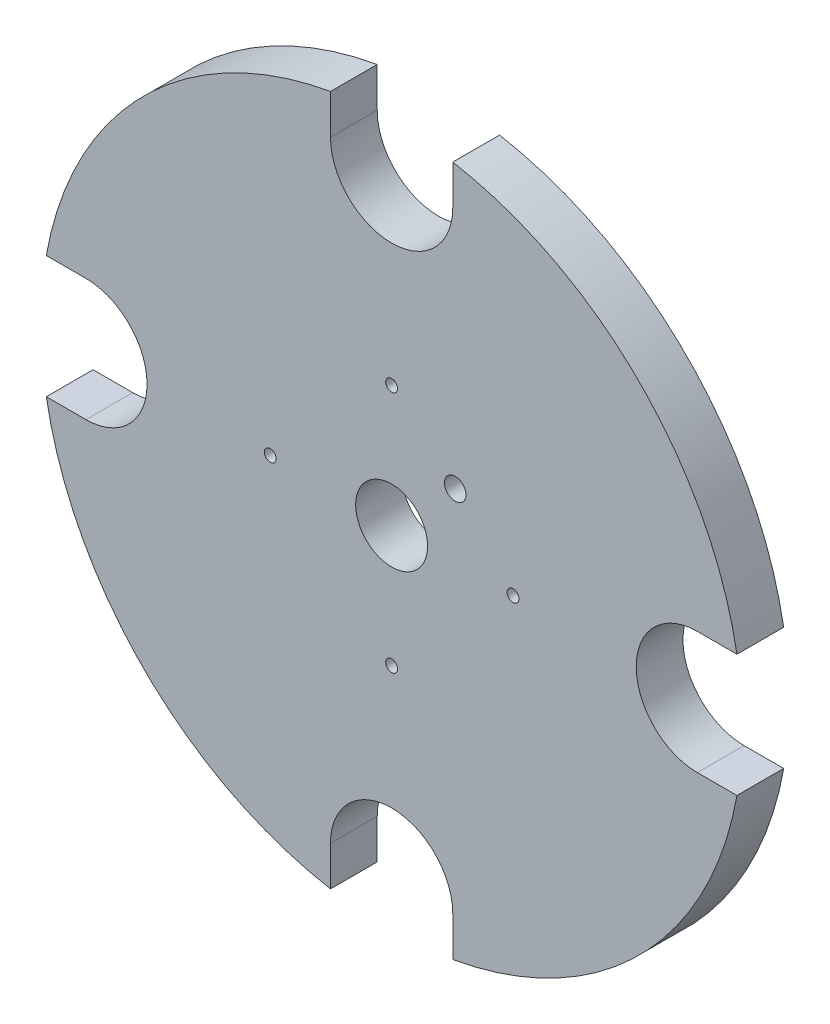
ISO-10303-21;
HEADER;
FILE_DESCRIPTION(('STEP AP214'),'2;1');
FILE_NAME('part.step','',(''),(''),'','','');
FILE_SCHEMA(('AUTOMOTIVE_DESIGN { 1 0 10303 214 1 1 1 1 }'));
ENDSEC;
DATA;
#1=APPLICATION_CONTEXT('core data for automotive mechanical design processes');
#2=APPLICATION_PROTOCOL_DEFINITION('international standard','automotive_design',2000,#1);
#3=PRODUCT_CONTEXT('',#1,'mechanical');
#4=PRODUCT('Part','Part','',(#3));
#5=PRODUCT_RELATED_PRODUCT_CATEGORY('part','',(#4));
#6=PRODUCT_DEFINITION_FORMATION('','',#4);
#7=PRODUCT_DEFINITION_CONTEXT('part definition',#1,'design');
#8=PRODUCT_DEFINITION('design','',#6,#7);
#9=PRODUCT_DEFINITION_SHAPE('','',#8);
#10=(LENGTH_UNIT() NAMED_UNIT(*) SI_UNIT(.MILLI.,.METRE.));
#11=(NAMED_UNIT(*) PLANE_ANGLE_UNIT() SI_UNIT($,.RADIAN.));
#12=(NAMED_UNIT(*) SI_UNIT($,.STERADIAN.) SOLID_ANGLE_UNIT());
#13=UNCERTAINTY_MEASURE_WITH_UNIT(LENGTH_MEASURE(1.E-05),#10,'distance_accuracy_value','');
#14=(GEOMETRIC_REPRESENTATION_CONTEXT(3) GLOBAL_UNCERTAINTY_ASSIGNED_CONTEXT((#13)) GLOBAL_UNIT_ASSIGNED_CONTEXT((#10,
#11,#12)) REPRESENTATION_CONTEXT('',''));
#15=CARTESIAN_POINT('',(0.,0.,0.));
#16=DIRECTION('',(0.,0.,1.));
#17=DIRECTION('',(1.,0.,0.));
#18=AXIS2_PLACEMENT_3D('',#15,#16,#17);
#19=CARTESIAN_POINT('',(35.3553390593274,35.3553390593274,-1.04603825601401E-11));
#20=DIRECTION('',(0.,0.,1.));
#21=DIRECTION('',(1.,0.,0.));
#22=AXIS2_PLACEMENT_3D('',#19,#20,#21);
#23=CYLINDRICAL_SURFACE('',#22,6.00000000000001);
#24=CARTESIAN_POINT('',(35.3553390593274,35.3553390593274,26.));
#25=DIRECTION('',(0.,0.,1.));
#26=DIRECTION('',(1.,0.,0.));
#27=AXIS2_PLACEMENT_3D('',#24,#25,#26);
#28=CIRCLE('',#27,6.00000000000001);
#29=CARTESIAN_POINT('',(41.3553390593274,35.3553390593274,26.));
#30=VERTEX_POINT('',#29);
#31=EDGE_CURVE('E381',#30,#30,#28,.T.);
#32=ORIENTED_EDGE('',*,*,#31,.T.);
#33=EDGE_LOOP('',(#32));
#34=FACE_BOUND('',#33,.T.);
#35=CARTESIAN_POINT('',(35.3553390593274,35.3553390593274,14.));
#36=DIRECTION('',(0.,0.,-1.));
#37=DIRECTION('',(-1.,0.,0.));
#38=AXIS2_PLACEMENT_3D('',#35,#36,#37);
#39=CIRCLE('',#38,6.00000000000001);
#40=CARTESIAN_POINT('',(29.3553390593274,35.3553390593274,14.));
#41=VERTEX_POINT('',#40);
#42=EDGE_CURVE('E36',#41,#41,#39,.F.);
#43=ORIENTED_EDGE('',*,*,#42,.F.);
#44=EDGE_LOOP('',(#43));
#45=FACE_BOUND('',#44,.T.);
#46=ADVANCED_FACE('F32',(#34,#45),#23,.F.);
#47=CARTESIAN_POINT('',(0.,0.,26.));
#48=DIRECTION('',(0.,0.,-1.));
#49=DIRECTION('',(-1.,0.,0.));
#50=AXIS2_PLACEMENT_3D('',#47,#48,#49);
#51=CYLINDRICAL_SURFACE('',#50,195.);
#52=CARTESIAN_POINT('',(0.,0.,26.));
#53=DIRECTION('',(0.,0.,1.));
#54=DIRECTION('',(1.,0.,0.));
#55=AXIS2_PLACEMENT_3D('',#52,#53,#54);
#56=CIRCLE('',#55,195.);
#57=CARTESIAN_POINT('',(-33.999999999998,192.013020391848,26.));
#58=VERTEX_POINT('',#57);
#59=CARTESIAN_POINT('',(-192.013020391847,34.0000000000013,26.));
#60=VERTEX_POINT('',#59);
#61=EDGE_CURVE('E41',#58,#60,#56,.T.);
#62=ORIENTED_EDGE('',*,*,#61,.F.);
#63=DIRECTION('',(0.,0.,1.));
#64=VECTOR('',#63,1.);
#65=CARTESIAN_POINT('',(-33.999999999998,192.013020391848,0.));
#66=LINE('',#65,#64);
#67=CARTESIAN_POINT('',(-33.999999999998,192.013020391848,0.));
#68=VERTEX_POINT('',#67);
#69=EDGE_CURVE('E180',#68,#58,#66,.T.);
#70=ORIENTED_EDGE('',*,*,#69,.F.);
#71=CARTESIAN_POINT('',(0.,0.,0.));
#72=DIRECTION('',(0.,0.,1.));
#73=DIRECTION('',(1.,0.,0.));
#74=AXIS2_PLACEMENT_3D('',#71,#72,#73);
#75=CIRCLE('',#74,195.);
#76=CARTESIAN_POINT('',(-192.013020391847,34.0000000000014,0.));
#77=VERTEX_POINT('',#76);
#78=EDGE_CURVE('E271',#68,#77,#75,.T.);
#79=ORIENTED_EDGE('',*,*,#78,.T.);
#80=DIRECTION('',(0.,0.,1.));
#81=VECTOR('',#80,1.);
#82=CARTESIAN_POINT('',(-192.013020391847,34.0000000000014,0.));
#83=LINE('',#82,#81);
#84=EDGE_CURVE('E205',#77,#60,#83,.T.);
#85=ORIENTED_EDGE('',*,*,#84,.T.);
#86=EDGE_LOOP('',(#62,#70,#79,#85));
#87=FACE_BOUND('',#86,.T.);
#88=ADVANCED_FACE('F312',(#87),#51,.T.);
#89=CARTESIAN_POINT('',(-192.013020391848,-33.9999999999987,26.));
#90=VERTEX_POINT('',#89);
#91=CARTESIAN_POINT('',(-34.0000000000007,-192.013020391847,26.));
#92=VERTEX_POINT('',#91);
#93=EDGE_CURVE('E275',#90,#92,#56,.T.);
#94=ORIENTED_EDGE('',*,*,#93,.F.);
#95=DIRECTION('',(0.,0.,1.));
#96=VECTOR('',#95,1.);
#97=CARTESIAN_POINT('',(-192.013020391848,-33.9999999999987,0.));
#98=LINE('',#97,#96);
#99=CARTESIAN_POINT('',(-192.013020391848,-33.9999999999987,0.));
#100=VERTEX_POINT('',#99);
#101=EDGE_CURVE('E203',#100,#90,#98,.T.);
#102=ORIENTED_EDGE('',*,*,#101,.F.);
#103=CARTESIAN_POINT('',(-34.0000000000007,-192.013020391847,0.));
#104=VERTEX_POINT('',#103);
#105=EDGE_CURVE('E276',#100,#104,#75,.T.);
#106=ORIENTED_EDGE('',*,*,#105,.T.);
#107=DIRECTION('',(0.,0.,1.));
#108=VECTOR('',#107,1.);
#109=CARTESIAN_POINT('',(-34.0000000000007,-192.013020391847,0.));
#110=LINE('',#109,#108);
#111=EDGE_CURVE('E232',#104,#92,#110,.T.);
#112=ORIENTED_EDGE('',*,*,#111,.T.);
#113=EDGE_LOOP('',(#94,#102,#106,#112));
#114=FACE_BOUND('',#113,.T.);
#115=ADVANCED_FACE('F286',(#114),#51,.T.);
#116=CARTESIAN_POINT('',(33.9999999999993,-192.013020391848,26.));
#117=VERTEX_POINT('',#116);
#118=CARTESIAN_POINT('',(192.013020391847,-34.,26.));
#119=VERTEX_POINT('',#118);
#120=EDGE_CURVE('E42',#117,#119,#56,.T.);
#121=ORIENTED_EDGE('',*,*,#120,.F.);
#122=DIRECTION('',(0.,0.,1.));
#123=VECTOR('',#122,1.);
#124=CARTESIAN_POINT('',(33.9999999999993,-192.013020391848,0.));
#125=LINE('',#124,#123);
#126=CARTESIAN_POINT('',(33.9999999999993,-192.013020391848,0.));
#127=VERTEX_POINT('',#126);
#128=EDGE_CURVE('E230',#127,#117,#125,.T.);
#129=ORIENTED_EDGE('',*,*,#128,.F.);
#130=CARTESIAN_POINT('',(192.013020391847,-34.,0.));
#131=VERTEX_POINT('',#130);
#132=EDGE_CURVE('E268',#127,#131,#75,.T.);
#133=ORIENTED_EDGE('',*,*,#132,.T.);
#134=DIRECTION('',(0.,0.,1.));
#135=VECTOR('',#134,1.);
#136=CARTESIAN_POINT('',(192.013020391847,-34.,0.));
#137=LINE('',#136,#135);
#138=EDGE_CURVE('E259',#131,#119,#137,.T.);
#139=ORIENTED_EDGE('',*,*,#138,.T.);
#140=EDGE_LOOP('',(#121,#129,#133,#139));
#141=FACE_BOUND('',#140,.T.);
#142=ADVANCED_FACE('F404',(#141),#51,.T.);
#143=CARTESIAN_POINT('',(0.,0.,26.));
#144=DIRECTION('',(0.,0.,1.));
#145=DIRECTION('',(1.,0.,0.));
#146=AXIS2_PLACEMENT_3D('',#143,#144,#145);
#147=PLANE('',#146);
#148=ORIENTED_EDGE('',*,*,#31,.F.);
#149=EDGE_LOOP('',(#148));
#150=FACE_BOUND('',#149,.T.);
#151=CARTESIAN_POINT('',(0.,67.5,26.));
#152=DIRECTION('',(0.,0.,1.));
#153=DIRECTION('',(1.,0.,0.));
#154=AXIS2_PLACEMENT_3D('',#151,#152,#153);
#155=CIRCLE('',#154,3.29999999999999);
#156=CARTESIAN_POINT('',(3.29999999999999,67.5,26.));
#157=VERTEX_POINT('',#156);
#158=EDGE_CURVE('E375',#157,#157,#155,.T.);
#159=ORIENTED_EDGE('',*,*,#158,.F.);
#160=EDGE_LOOP('',(#159));
#161=FACE_BOUND('',#160,.T.);
#162=CARTESIAN_POINT('',(67.5,0.,26.));
#163=DIRECTION('',(0.,0.,1.));
#164=DIRECTION('',(1.,0.,0.));
#165=AXIS2_PLACEMENT_3D('',#162,#163,#164);
#166=CIRCLE('',#165,3.29999999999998);
#167=CARTESIAN_POINT('',(70.8,0.,26.));
#168=VERTEX_POINT('',#167);
#169=EDGE_CURVE('E369',#168,#168,#166,.T.);
#170=ORIENTED_EDGE('',*,*,#169,.F.);
#171=EDGE_LOOP('',(#170));
#172=FACE_BOUND('',#171,.T.);
#173=CARTESIAN_POINT('',(0.,-67.5,26.));
#174=DIRECTION('',(0.,0.,1.));
#175=DIRECTION('',(1.,0.,0.));
#176=AXIS2_PLACEMENT_3D('',#173,#174,#175);
#177=CIRCLE('',#176,3.29999999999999);
#178=CARTESIAN_POINT('',(3.29999999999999,-67.5,26.));
#179=VERTEX_POINT('',#178);
#180=EDGE_CURVE('E361',#179,#179,#177,.T.);
#181=ORIENTED_EDGE('',*,*,#180,.F.);
#182=EDGE_LOOP('',(#181));
#183=FACE_BOUND('',#182,.T.);
#184=CARTESIAN_POINT('',(-67.5,0.,26.));
#185=DIRECTION('',(0.,0.,1.));
#186=DIRECTION('',(1.,0.,0.));
#187=AXIS2_PLACEMENT_3D('',#184,#185,#186);
#188=CIRCLE('',#187,3.29999999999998);
#189=CARTESIAN_POINT('',(-64.2,0.,26.));
#190=VERTEX_POINT('',#189);
#191=EDGE_CURVE('E162',#190,#190,#188,.T.);
#192=ORIENTED_EDGE('',*,*,#191,.F.);
#193=EDGE_LOOP('',(#192));
#194=FACE_BOUND('',#193,.T.);
#195=DIRECTION('',(0.,-1.,0.));
#196=VECTOR('',#195,1.);
#197=CARTESIAN_POINT('',(-33.9999999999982,170.,26.));
#198=LINE('',#197,#196);
#199=CARTESIAN_POINT('',(-33.9999999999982,170.,26.));
#200=VERTEX_POINT('',#199);
#201=EDGE_CURVE('E168',#58,#200,#198,.T.);
#202=ORIENTED_EDGE('',*,*,#201,.F.);
#203=ORIENTED_EDGE('',*,*,#61,.T.);
#204=DIRECTION('',(-1.,0.,0.));
#205=VECTOR('',#204,1.);
#206=CARTESIAN_POINT('',(-170.,34.0000000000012,26.));
#207=LINE('',#206,#205);
#208=CARTESIAN_POINT('',(-170.,34.0000000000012,26.));
#209=VERTEX_POINT('',#208);
#210=EDGE_CURVE('E185',#209,#60,#207,.T.);
#211=ORIENTED_EDGE('',*,*,#210,.F.);
#212=CARTESIAN_POINT('',(-170.,1.18710434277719E-12,26.));
#213=DIRECTION('',(0.,0.,1.));
#214=DIRECTION('',(1.,0.,0.));
#215=AXIS2_PLACEMENT_3D('',#212,#213,#214);
#216=CIRCLE('',#215,34.);
#217=CARTESIAN_POINT('',(-170.,-33.9999999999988,26.));
#218=VERTEX_POINT('',#217);
#219=EDGE_CURVE('E179',#218,#209,#216,.T.);
#220=ORIENTED_EDGE('',*,*,#219,.F.);
#221=DIRECTION('',(1.,0.,0.));
#222=VECTOR('',#221,1.);
#223=CARTESIAN_POINT('',(-170.,-33.9999999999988,26.));
#224=LINE('',#223,#222);
#225=EDGE_CURVE('E187',#90,#218,#224,.T.);
#226=ORIENTED_EDGE('',*,*,#225,.F.);
#227=ORIENTED_EDGE('',*,*,#93,.T.);
#228=DIRECTION('',(0.,-1.,0.));
#229=VECTOR('',#228,1.);
#230=CARTESIAN_POINT('',(-34.0000000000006,-170.,26.));
#231=LINE('',#230,#229);
#232=CARTESIAN_POINT('',(-34.0000000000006,-170.,26.));
#233=VERTEX_POINT('',#232);
#234=EDGE_CURVE('E211',#233,#92,#231,.T.);
#235=ORIENTED_EDGE('',*,*,#234,.F.);
#236=CARTESIAN_POINT('',(-5.93552171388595E-13,-170.,26.));
#237=DIRECTION('',(0.,0.,1.));
#238=DIRECTION('',(1.,0.,0.));
#239=AXIS2_PLACEMENT_3D('',#236,#237,#238);
#240=CIRCLE('',#239,34.);
#241=CARTESIAN_POINT('',(33.9999999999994,-170.,26.));
#242=VERTEX_POINT('',#241);
#243=EDGE_CURVE('E202',#242,#233,#240,.T.);
#244=ORIENTED_EDGE('',*,*,#243,.F.);
#245=DIRECTION('',(0.,1.,0.));
#246=VECTOR('',#245,1.);
#247=CARTESIAN_POINT('',(33.9999999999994,-170.,26.));
#248=LINE('',#247,#246);
#249=EDGE_CURVE('E214',#117,#242,#248,.T.);
#250=ORIENTED_EDGE('',*,*,#249,.F.);
#251=ORIENTED_EDGE('',*,*,#120,.T.);
#252=DIRECTION('',(1.,0.,0.));
#253=VECTOR('',#252,1.);
#254=CARTESIAN_POINT('',(170.,-34.,26.));
#255=LINE('',#254,#253);
#256=CARTESIAN_POINT('',(170.,-34.,26.));
#257=VERTEX_POINT('',#256);
#258=EDGE_CURVE('E238',#257,#119,#255,.T.);
#259=ORIENTED_EDGE('',*,*,#258,.F.);
#260=CARTESIAN_POINT('',(170.,0.,26.));
#261=DIRECTION('',(0.,0.,1.));
#262=DIRECTION('',(1.,0.,0.));
#263=AXIS2_PLACEMENT_3D('',#260,#261,#262);
#264=CIRCLE('',#263,34.);
#265=CARTESIAN_POINT('',(170.,34.,26.));
#266=VERTEX_POINT('',#265);
#267=EDGE_CURVE('E229',#266,#257,#264,.T.);
#268=ORIENTED_EDGE('',*,*,#267,.F.);
#269=DIRECTION('',(-1.,0.,0.));
#270=VECTOR('',#269,1.);
#271=CARTESIAN_POINT('',(170.,34.,26.));
#272=LINE('',#271,#270);
#273=CARTESIAN_POINT('',(192.013020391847,34.,26.));
#274=VERTEX_POINT('',#273);
#275=EDGE_CURVE('E241',#274,#266,#272,.T.);
#276=ORIENTED_EDGE('',*,*,#275,.F.);
#277=CARTESIAN_POINT('',(34.000000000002,192.013020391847,26.));
#278=VERTEX_POINT('',#277);
#279=EDGE_CURVE('E11',#274,#278,#56,.T.);
#280=ORIENTED_EDGE('',*,*,#279,.T.);
#281=DIRECTION('',(0.,1.,0.));
#282=VECTOR('',#281,1.);
#283=CARTESIAN_POINT('',(34.0000000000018,170.,26.));
#284=LINE('',#283,#282);
#285=CARTESIAN_POINT('',(34.0000000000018,170.,26.));
#286=VERTEX_POINT('',#285);
#287=EDGE_CURVE('E49',#286,#278,#284,.T.);
#288=ORIENTED_EDGE('',*,*,#287,.F.);
#289=CARTESIAN_POINT('',(1.78065651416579E-12,170.,26.));
#290=DIRECTION('',(0.,0.,1.));
#291=DIRECTION('',(1.,0.,0.));
#292=AXIS2_PLACEMENT_3D('',#289,#290,#291);
#293=CIRCLE('',#292,34.);
#294=EDGE_CURVE('E158',#200,#286,#293,.T.);
#295=ORIENTED_EDGE('',*,*,#294,.F.);
#296=EDGE_LOOP('',(#202,#203,#211,#220,#226,#227,#235,#244,#250,#251,#259,#268,#276,#280,#288,#295));
#297=FACE_BOUND('',#296,.T.);
#298=CARTESIAN_POINT('',(0.,0.,26.));
#299=DIRECTION('',(0.,0.,1.));
#300=DIRECTION('',(1.,0.,0.));
#301=AXIS2_PLACEMENT_3D('',#298,#299,#300);
#302=CIRCLE('',#301,20.);
#303=CARTESIAN_POINT('',(-20.,0.,26.));
#304=VERTEX_POINT('',#303);
#305=EDGE_CURVE('E265',#304,#304,#302,.T.);
#306=ORIENTED_EDGE('',*,*,#305,.F.);
#307=EDGE_LOOP('',(#306));
#308=FACE_BOUND('',#307,.T.);
#309=ADVANCED_FACE('F164',(#150,#161,#172,#183,#194,#297,#308),#147,.T.);
#310=CARTESIAN_POINT('',(0.,0.,0.));
#311=DIRECTION('',(0.,0.,1.));
#312=DIRECTION('',(1.,0.,0.));
#313=AXIS2_PLACEMENT_3D('',#310,#311,#312);
#314=PLANE('',#313);
#315=CARTESIAN_POINT('',(35.3553390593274,35.3553390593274,0.));
#316=DIRECTION('',(0.,0.,-1.));
#317=DIRECTION('',(-1.,0.,0.));
#318=AXIS2_PLACEMENT_3D('',#315,#316,#317);
#319=CIRCLE('',#318,18.);
#320=CARTESIAN_POINT('',(17.3553390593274,35.3553390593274,0.));
#321=VERTEX_POINT('',#320);
#322=EDGE_CURVE('E386',#321,#321,#319,.T.);
#323=ORIENTED_EDGE('',*,*,#322,.F.);
#324=EDGE_LOOP('',(#323));
#325=FACE_BOUND('',#324,.T.);
#326=CARTESIAN_POINT('',(0.,67.5,-1.04603825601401E-11));
#327=DIRECTION('',(0.,0.,1.));
#328=DIRECTION('',(1.,0.,0.));
#329=AXIS2_PLACEMENT_3D('',#326,#327,#328);
#330=CIRCLE('',#329,3.3);
#331=CARTESIAN_POINT('',(3.3,67.5,-1.04603825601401E-11));
#332=VERTEX_POINT('',#331);
#333=EDGE_CURVE('E378',#332,#332,#330,.T.);
#334=ORIENTED_EDGE('',*,*,#333,.T.);
#335=EDGE_LOOP('',(#334));
#336=FACE_BOUND('',#335,.T.);
#337=CARTESIAN_POINT('',(67.5,0.,-1.04603825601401E-11));
#338=DIRECTION('',(0.,0.,1.));
#339=DIRECTION('',(1.,0.,0.));
#340=AXIS2_PLACEMENT_3D('',#337,#338,#339);
#341=CIRCLE('',#340,3.3);
#342=CARTESIAN_POINT('',(70.8,0.,-1.04603825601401E-11));
#343=VERTEX_POINT('',#342);
#344=EDGE_CURVE('E372',#343,#343,#341,.T.);
#345=ORIENTED_EDGE('',*,*,#344,.T.);
#346=EDGE_LOOP('',(#345));
#347=FACE_BOUND('',#346,.T.);
#348=CARTESIAN_POINT('',(0.,-67.5,-1.04603825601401E-11));
#349=DIRECTION('',(0.,0.,1.));
#350=DIRECTION('',(1.,0.,0.));
#351=AXIS2_PLACEMENT_3D('',#348,#349,#350);
#352=CIRCLE('',#351,3.3);
#353=CARTESIAN_POINT('',(3.3,-67.5,-1.04603825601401E-11));
#354=VERTEX_POINT('',#353);
#355=EDGE_CURVE('E366',#354,#354,#352,.T.);
#356=ORIENTED_EDGE('',*,*,#355,.T.);
#357=EDGE_LOOP('',(#356));
#358=FACE_BOUND('',#357,.T.);
#359=CARTESIAN_POINT('',(-67.5,0.,-1.04603825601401E-11));
#360=DIRECTION('',(0.,0.,1.));
#361=DIRECTION('',(1.,0.,0.));
#362=AXIS2_PLACEMENT_3D('',#359,#360,#361);
#363=CIRCLE('',#362,3.3);
#364=CARTESIAN_POINT('',(-64.2,0.,-1.04603825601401E-11));
#365=VERTEX_POINT('',#364);
#366=EDGE_CURVE('E357',#365,#365,#363,.T.);
#367=ORIENTED_EDGE('',*,*,#366,.T.);
#368=EDGE_LOOP('',(#367));
#369=FACE_BOUND('',#368,.T.);
#370=ORIENTED_EDGE('',*,*,#78,.F.);
#371=DIRECTION('',(0.,-1.,0.));
#372=VECTOR('',#371,1.);
#373=CARTESIAN_POINT('',(-33.9999999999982,170.,0.));
#374=LINE('',#373,#372);
#375=CARTESIAN_POINT('',(-33.9999999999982,170.,0.));
#376=VERTEX_POINT('',#375);
#377=EDGE_CURVE('E155',#68,#376,#374,.T.);
#378=ORIENTED_EDGE('',*,*,#377,.T.);
#379=CARTESIAN_POINT('',(1.78065651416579E-12,170.,0.));
#380=DIRECTION('',(0.,0.,1.));
#381=DIRECTION('',(1.,0.,0.));
#382=AXIS2_PLACEMENT_3D('',#379,#380,#381);
#383=CIRCLE('',#382,34.);
#384=CARTESIAN_POINT('',(34.0000000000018,170.,0.));
#385=VERTEX_POINT('',#384);
#386=EDGE_CURVE('E170',#376,#385,#383,.T.);
#387=ORIENTED_EDGE('',*,*,#386,.T.);
#388=DIRECTION('',(0.,1.,0.));
#389=VECTOR('',#388,1.);
#390=CARTESIAN_POINT('',(34.0000000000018,170.,0.));
#391=LINE('',#390,#389);
#392=CARTESIAN_POINT('',(34.000000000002,192.013020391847,0.));
#393=VERTEX_POINT('',#392);
#394=EDGE_CURVE('E150',#385,#393,#391,.T.);
#395=ORIENTED_EDGE('',*,*,#394,.T.);
#396=CARTESIAN_POINT('',(192.013020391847,34.,0.));
#397=VERTEX_POINT('',#396);
#398=EDGE_CURVE('E269',#397,#393,#75,.T.);
#399=ORIENTED_EDGE('',*,*,#398,.F.);
#400=DIRECTION('',(-1.,0.,0.));
#401=VECTOR('',#400,1.);
#402=CARTESIAN_POINT('',(170.,34.,0.));
#403=LINE('',#402,#401);
#404=CARTESIAN_POINT('',(170.,34.,0.));
#405=VERTEX_POINT('',#404);
#406=EDGE_CURVE('E250',#397,#405,#403,.T.);
#407=ORIENTED_EDGE('',*,*,#406,.T.);
#408=CARTESIAN_POINT('',(170.,0.,0.));
#409=DIRECTION('',(0.,0.,1.));
#410=DIRECTION('',(1.,0.,0.));
#411=AXIS2_PLACEMENT_3D('',#408,#409,#410);
#412=CIRCLE('',#411,34.);
#413=CARTESIAN_POINT('',(170.,-34.,0.));
#414=VERTEX_POINT('',#413);
#415=EDGE_CURVE('E244',#405,#414,#412,.T.);
#416=ORIENTED_EDGE('',*,*,#415,.T.);
#417=DIRECTION('',(1.,0.,0.));
#418=VECTOR('',#417,1.);
#419=CARTESIAN_POINT('',(170.,-34.,0.));
#420=LINE('',#419,#418);
#421=EDGE_CURVE('E247',#414,#131,#420,.T.);
#422=ORIENTED_EDGE('',*,*,#421,.T.);
#423=ORIENTED_EDGE('',*,*,#132,.F.);
#424=DIRECTION('',(0.,1.,0.));
#425=VECTOR('',#424,1.);
#426=CARTESIAN_POINT('',(33.9999999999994,-170.,0.));
#427=LINE('',#426,#425);
#428=CARTESIAN_POINT('',(33.9999999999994,-170.,0.));
#429=VERTEX_POINT('',#428);
#430=EDGE_CURVE('E223',#127,#429,#427,.T.);
#431=ORIENTED_EDGE('',*,*,#430,.T.);
#432=CARTESIAN_POINT('',(-5.93552171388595E-13,-170.,0.));
#433=DIRECTION('',(0.,0.,1.));
#434=DIRECTION('',(1.,0.,0.));
#435=AXIS2_PLACEMENT_3D('',#432,#433,#434);
#436=CIRCLE('',#435,34.);
#437=CARTESIAN_POINT('',(-34.0000000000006,-170.,0.));
#438=VERTEX_POINT('',#437);
#439=EDGE_CURVE('E217',#429,#438,#436,.T.);
#440=ORIENTED_EDGE('',*,*,#439,.T.);
#441=DIRECTION('',(0.,-1.,0.));
#442=VECTOR('',#441,1.);
#443=CARTESIAN_POINT('',(-34.0000000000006,-170.,0.));
#444=LINE('',#443,#442);
#445=EDGE_CURVE('E220',#438,#104,#444,.T.);
#446=ORIENTED_EDGE('',*,*,#445,.T.);
#447=ORIENTED_EDGE('',*,*,#105,.F.);
#448=DIRECTION('',(1.,0.,0.));
#449=VECTOR('',#448,1.);
#450=CARTESIAN_POINT('',(-170.,-33.9999999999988,0.));
#451=LINE('',#450,#449);
#452=CARTESIAN_POINT('',(-170.,-33.9999999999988,0.));
#453=VERTEX_POINT('',#452);
#454=EDGE_CURVE('E196',#100,#453,#451,.T.);
#455=ORIENTED_EDGE('',*,*,#454,.T.);
#456=CARTESIAN_POINT('',(-170.,1.18710434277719E-12,0.));
#457=DIRECTION('',(0.,0.,1.));
#458=DIRECTION('',(1.,0.,0.));
#459=AXIS2_PLACEMENT_3D('',#456,#457,#458);
#460=CIRCLE('',#459,34.);
#461=CARTESIAN_POINT('',(-170.,34.0000000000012,0.));
#462=VERTEX_POINT('',#461);
#463=EDGE_CURVE('E190',#453,#462,#460,.T.);
#464=ORIENTED_EDGE('',*,*,#463,.T.);
#465=DIRECTION('',(-1.,0.,0.));
#466=VECTOR('',#465,1.);
#467=CARTESIAN_POINT('',(-170.,34.0000000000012,0.));
#468=LINE('',#467,#466);
#469=EDGE_CURVE('E193',#462,#77,#468,.T.);
#470=ORIENTED_EDGE('',*,*,#469,.T.);
#471=EDGE_LOOP('',(#370,#378,#387,#395,#399,#407,#416,#422,#423,#431,#440,#446,#447,#455,#464,#470));
#472=FACE_BOUND('',#471,.T.);
#473=CARTESIAN_POINT('',(0.,0.,0.));
#474=DIRECTION('',(0.,0.,1.));
#475=DIRECTION('',(1.,0.,0.));
#476=AXIS2_PLACEMENT_3D('',#473,#474,#475);
#477=CIRCLE('',#476,20.);
#478=CARTESIAN_POINT('',(-20.,0.,0.));
#479=VERTEX_POINT('',#478);
#480=EDGE_CURVE('E256',#479,#479,#477,.T.);
#481=ORIENTED_EDGE('',*,*,#480,.T.);
#482=EDGE_LOOP('',(#481));
#483=FACE_BOUND('',#482,.T.);
#484=ADVANCED_FACE('F293',(#325,#336,#347,#358,#369,#472,#483),#314,.F.);
#485=ORIENTED_EDGE('',*,*,#398,.T.);
#486=DIRECTION('',(0.,0.,1.));
#487=VECTOR('',#486,1.);
#488=CARTESIAN_POINT('',(34.000000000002,192.013020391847,0.));
#489=LINE('',#488,#487);
#490=EDGE_CURVE('E154',#393,#278,#489,.T.);
#491=ORIENTED_EDGE('',*,*,#490,.T.);
#492=ORIENTED_EDGE('',*,*,#279,.F.);
#493=DIRECTION('',(0.,0.,1.));
#494=VECTOR('',#493,1.);
#495=CARTESIAN_POINT('',(192.013020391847,34.,0.));
#496=LINE('',#495,#494);
#497=EDGE_CURVE('E257',#397,#274,#496,.T.);
#498=ORIENTED_EDGE('',*,*,#497,.F.);
#499=EDGE_LOOP('',(#485,#491,#492,#498));
#500=FACE_BOUND('',#499,.T.);
#501=ADVANCED_FACE('F34',(#500),#51,.T.);
#502=CARTESIAN_POINT('',(0.,0.,26.));
#503=DIRECTION('',(0.,0.,-1.));
#504=DIRECTION('',(-1.,0.,0.));
#505=AXIS2_PLACEMENT_3D('',#502,#503,#504);
#506=CYLINDRICAL_SURFACE('',#505,20.);
#507=CARTESIAN_POINT('',(-20.,0.,26.));
#508=CARTESIAN_POINT('',(-20.,0.,25.7291666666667));
#509=CARTESIAN_POINT('',(-20.,0.,25.4583333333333));
#510=CARTESIAN_POINT('',(-20.,0.,24.9166666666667));
#511=CARTESIAN_POINT('',(-20.,0.,24.6458333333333));
#512=CARTESIAN_POINT('',(-20.,0.,24.1041666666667));
#513=CARTESIAN_POINT('',(-20.,0.,23.8333333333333));
#514=CARTESIAN_POINT('',(-20.,0.,23.2916666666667));
#515=CARTESIAN_POINT('',(-20.,0.,23.0208333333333));
#516=CARTESIAN_POINT('',(-20.,0.,22.4791666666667));
#517=CARTESIAN_POINT('',(-20.,0.,22.2083333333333));
#518=CARTESIAN_POINT('',(-20.,0.,21.6666666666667));
#519=CARTESIAN_POINT('',(-20.,0.,21.3958333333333));
#520=CARTESIAN_POINT('',(-20.,0.,20.8541666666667));
#521=CARTESIAN_POINT('',(-20.,0.,20.5833333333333));
#522=CARTESIAN_POINT('',(-20.,0.,20.0416666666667));
#523=CARTESIAN_POINT('',(-20.,0.,19.7708333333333));
#524=CARTESIAN_POINT('',(-20.,0.,19.2291666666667));
#525=CARTESIAN_POINT('',(-20.,0.,18.9583333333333));
#526=CARTESIAN_POINT('',(-20.,0.,18.4166666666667));
#527=CARTESIAN_POINT('',(-20.,0.,18.1458333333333));
#528=CARTESIAN_POINT('',(-20.,0.,17.6041666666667));
#529=CARTESIAN_POINT('',(-20.,0.,17.3333333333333));
#530=CARTESIAN_POINT('',(-20.,0.,16.7916666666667));
#531=CARTESIAN_POINT('',(-20.,0.,16.5208333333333));
#532=CARTESIAN_POINT('',(-20.,0.,15.9791666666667));
#533=CARTESIAN_POINT('',(-20.,0.,15.7083333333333));
#534=CARTESIAN_POINT('',(-20.,0.,15.1666666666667));
#535=CARTESIAN_POINT('',(-20.,0.,14.8958333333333));
#536=CARTESIAN_POINT('',(-20.,0.,14.3541666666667));
#537=CARTESIAN_POINT('',(-20.,0.,14.0833333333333));
#538=CARTESIAN_POINT('',(-20.,0.,13.5416666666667));
#539=CARTESIAN_POINT('',(-20.,0.,13.2708333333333));
#540=CARTESIAN_POINT('',(-20.,0.,12.7291666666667));
#541=CARTESIAN_POINT('',(-20.,0.,12.4583333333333));
#542=CARTESIAN_POINT('',(-20.,0.,11.9166666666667));
#543=CARTESIAN_POINT('',(-20.,0.,11.6458333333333));
#544=CARTESIAN_POINT('',(-20.,0.,11.1041666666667));
#545=CARTESIAN_POINT('',(-20.,0.,10.8333333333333));
#546=CARTESIAN_POINT('',(-20.,0.,10.2916666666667));
#547=CARTESIAN_POINT('',(-20.,0.,10.0208333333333));
#548=CARTESIAN_POINT('',(-20.,0.,9.47916666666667));
#549=CARTESIAN_POINT('',(-20.,0.,9.20833333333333));
#550=CARTESIAN_POINT('',(-20.,0.,8.66666666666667));
#551=CARTESIAN_POINT('',(-20.,0.,8.39583333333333));
#552=CARTESIAN_POINT('',(-20.,0.,7.85416666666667));
#553=CARTESIAN_POINT('',(-20.,0.,7.58333333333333));
#554=CARTESIAN_POINT('',(-20.,0.,7.04166666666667));
#555=CARTESIAN_POINT('',(-20.,0.,6.77083333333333));
#556=CARTESIAN_POINT('',(-20.,0.,6.22916666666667));
#557=CARTESIAN_POINT('',(-20.,0.,5.95833333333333));
#558=CARTESIAN_POINT('',(-20.,0.,5.41666666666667));
#559=CARTESIAN_POINT('',(-20.,0.,5.14583333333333));
#560=CARTESIAN_POINT('',(-20.,0.,4.60416666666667));
#561=CARTESIAN_POINT('',(-20.,0.,4.33333333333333));
#562=CARTESIAN_POINT('',(-20.,0.,3.79166666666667));
#563=CARTESIAN_POINT('',(-20.,0.,3.52083333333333));
#564=CARTESIAN_POINT('',(-20.,0.,2.97916666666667));
#565=CARTESIAN_POINT('',(-20.,0.,2.70833333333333));
#566=CARTESIAN_POINT('',(-20.,0.,2.16666666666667));
#567=CARTESIAN_POINT('',(-20.,0.,1.89583333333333));
#568=CARTESIAN_POINT('',(-20.,0.,1.35416666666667));
#569=CARTESIAN_POINT('',(-20.,0.,1.08333333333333));
#570=CARTESIAN_POINT('',(-20.,0.,0.541666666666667));
#571=CARTESIAN_POINT('',(-20.,0.,0.270833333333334));
#572=CARTESIAN_POINT('',(-20.,0.,0.));
#573=B_SPLINE_CURVE_WITH_KNOTS('',3,(#507,#508,#509,#510,#511,#512,#513,#514,#515,#516,#517,
#518,#519,#520,#521,#522,#523,#524,#525,#526,#527,#528,#529,#530,#531,#532,#533,#534,#535,#536,
#537,#538,#539,#540,#541,#542,#543,#544,#545,#546,#547,#548,#549,#550,#551,#552,#553,#554,#555,
#556,#557,#558,#559,#560,#561,#562,#563,#564,#565,#566,#567,#568,#569,#570,#571,#572),
.UNSPECIFIED.,.F.,.F.,(4,2,2,2,2,2,2,2,2,2,2,2,2,2,2,2,2,2,2,2,2,2,2,2,2,2,2,2,2,2,2,2,4),(0.,
0.812500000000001,1.625,2.4375,3.25,4.0625,4.875,5.6875,6.5,7.3125,8.125,8.9375,9.75,10.5625,
11.375,12.1875,13.,13.8125,14.625,15.4375,16.25,17.0625,17.875,18.6875,19.5,20.3125,21.125,
21.9375,22.75,23.5625,24.375,25.1875,26.),.UNSPECIFIED.);
#574=EDGE_CURVE('BSEAM412',#304,#479,#573,.T.);
#575=ORIENTED_EDGE('',*,*,#305,.T.);
#576=ORIENTED_EDGE('',*,*,#480,.F.);
#577=ORIENTED_EDGE('',*,*,#574,.T.);
#578=ORIENTED_EDGE('',*,*,#574,.F.);
#579=EDGE_LOOP('',(#575,#577,#576,#578));
#580=FACE_BOUND('',#579,.T.);
#581=ADVANCED_FACE('F412',(#580),#506,.F.);
#582=CARTESIAN_POINT('',(170.,0.,0.));
#583=DIRECTION('',(0.,0.,1.));
#584=DIRECTION('',(1.,0.,0.));
#585=AXIS2_PLACEMENT_3D('',#582,#583,#584);
#586=CYLINDRICAL_SURFACE('',#585,34.);
#587=ORIENTED_EDGE('',*,*,#267,.T.);
#588=DIRECTION('',(0.,0.,1.));
#589=VECTOR('',#588,1.);
#590=CARTESIAN_POINT('',(170.,-34.,0.));
#591=LINE('',#590,#589);
#592=EDGE_CURVE('E253',#414,#257,#591,.T.);
#593=ORIENTED_EDGE('',*,*,#592,.F.);
#594=ORIENTED_EDGE('',*,*,#415,.F.);
#595=DIRECTION('',(0.,0.,1.));
#596=VECTOR('',#595,1.);
#597=CARTESIAN_POINT('',(170.,34.,0.));
#598=LINE('',#597,#596);
#599=EDGE_CURVE('E254',#405,#266,#598,.T.);
#600=ORIENTED_EDGE('',*,*,#599,.T.);
#601=EDGE_LOOP('',(#587,#593,#594,#600));
#602=FACE_BOUND('',#601,.T.);
#603=ADVANCED_FACE('F415',(#602),#586,.F.);
#604=CARTESIAN_POINT('',(170.,34.,0.));
#605=DIRECTION('',(0.,1.,0.));
#606=DIRECTION('',(0.,0.,1.));
#607=AXIS2_PLACEMENT_3D('',#604,#605,#606);
#608=PLANE('',#607);
#609=ORIENTED_EDGE('',*,*,#275,.T.);
#610=ORIENTED_EDGE('',*,*,#599,.F.);
#611=ORIENTED_EDGE('',*,*,#406,.F.);
#612=ORIENTED_EDGE('',*,*,#497,.T.);
#613=EDGE_LOOP('',(#609,#610,#611,#612));
#614=FACE_BOUND('',#613,.T.);
#615=ADVANCED_FACE('F419',(#614),#608,.F.);
#616=CARTESIAN_POINT('',(170.,-34.,0.));
#617=DIRECTION('',(0.,-1.,0.));
#618=DIRECTION('',(1.,0.,0.));
#619=AXIS2_PLACEMENT_3D('',#616,#617,#618);
#620=PLANE('',#619);
#621=ORIENTED_EDGE('',*,*,#258,.T.);
#622=ORIENTED_EDGE('',*,*,#138,.F.);
#623=ORIENTED_EDGE('',*,*,#421,.F.);
#624=ORIENTED_EDGE('',*,*,#592,.T.);
#625=EDGE_LOOP('',(#621,#622,#623,#624));
#626=FACE_BOUND('',#625,.T.);
#627=ADVANCED_FACE('F421',(#626),#620,.F.);
#628=CARTESIAN_POINT('',(-5.93552171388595E-13,-170.,0.));
#629=DIRECTION('',(0.,0.,1.));
#630=DIRECTION('',(1.,0.,0.));
#631=AXIS2_PLACEMENT_3D('',#628,#629,#630);
#632=CYLINDRICAL_SURFACE('',#631,34.);
#633=ORIENTED_EDGE('',*,*,#243,.T.);
#634=DIRECTION('',(0.,0.,1.));
#635=VECTOR('',#634,1.);
#636=CARTESIAN_POINT('',(-34.0000000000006,-170.,0.));
#637=LINE('',#636,#635);
#638=EDGE_CURVE('E226',#438,#233,#637,.T.);
#639=ORIENTED_EDGE('',*,*,#638,.F.);
#640=ORIENTED_EDGE('',*,*,#439,.F.);
#641=DIRECTION('',(0.,0.,1.));
#642=VECTOR('',#641,1.);
#643=CARTESIAN_POINT('',(33.9999999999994,-170.,0.));
#644=LINE('',#643,#642);
#645=EDGE_CURVE('E227',#429,#242,#644,.T.);
#646=ORIENTED_EDGE('',*,*,#645,.T.);
#647=EDGE_LOOP('',(#633,#639,#640,#646));
#648=FACE_BOUND('',#647,.T.);
#649=ADVANCED_FACE('F297',(#648),#632,.F.);
#650=CARTESIAN_POINT('',(33.9999999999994,-170.,0.));
#651=DIRECTION('',(1.,0.,0.));
#652=DIRECTION('',(0.,1.,0.));
#653=AXIS2_PLACEMENT_3D('',#650,#651,#652);
#654=PLANE('',#653);
#655=ORIENTED_EDGE('',*,*,#249,.T.);
#656=ORIENTED_EDGE('',*,*,#645,.F.);
#657=ORIENTED_EDGE('',*,*,#430,.F.);
#658=ORIENTED_EDGE('',*,*,#128,.T.);
#659=EDGE_LOOP('',(#655,#656,#657,#658));
#660=FACE_BOUND('',#659,.T.);
#661=ADVANCED_FACE('F430',(#660),#654,.F.);
#662=CARTESIAN_POINT('',(-34.0000000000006,-170.,0.));
#663=DIRECTION('',(-1.,0.,0.));
#664=DIRECTION('',(0.,-1.,0.));
#665=AXIS2_PLACEMENT_3D('',#662,#663,#664);
#666=PLANE('',#665);
#667=ORIENTED_EDGE('',*,*,#234,.T.);
#668=ORIENTED_EDGE('',*,*,#111,.F.);
#669=ORIENTED_EDGE('',*,*,#445,.F.);
#670=ORIENTED_EDGE('',*,*,#638,.T.);
#671=EDGE_LOOP('',(#667,#668,#669,#670));
#672=FACE_BOUND('',#671,.T.);
#673=ADVANCED_FACE('F290',(#672),#666,.F.);
#674=CARTESIAN_POINT('',(-170.,1.18710434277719E-12,0.));
#675=DIRECTION('',(0.,0.,1.));
#676=DIRECTION('',(1.,0.,0.));
#677=AXIS2_PLACEMENT_3D('',#674,#675,#676);
#678=CYLINDRICAL_SURFACE('',#677,34.);
#679=ORIENTED_EDGE('',*,*,#219,.T.);
#680=DIRECTION('',(0.,0.,1.));
#681=VECTOR('',#680,1.);
#682=CARTESIAN_POINT('',(-170.,34.0000000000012,0.));
#683=LINE('',#682,#681);
#684=EDGE_CURVE('E199',#462,#209,#683,.T.);
#685=ORIENTED_EDGE('',*,*,#684,.F.);
#686=ORIENTED_EDGE('',*,*,#463,.F.);
#687=DIRECTION('',(0.,0.,1.));
#688=VECTOR('',#687,1.);
#689=CARTESIAN_POINT('',(-170.,-33.9999999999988,0.));
#690=LINE('',#689,#688);
#691=EDGE_CURVE('E200',#453,#218,#690,.T.);
#692=ORIENTED_EDGE('',*,*,#691,.T.);
#693=EDGE_LOOP('',(#679,#685,#686,#692));
#694=FACE_BOUND('',#693,.T.);
#695=ADVANCED_FACE('F307',(#694),#678,.F.);
#696=CARTESIAN_POINT('',(-170.,-33.9999999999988,0.));
#697=DIRECTION('',(0.,-1.,0.));
#698=DIRECTION('',(1.,0.,0.));
#699=AXIS2_PLACEMENT_3D('',#696,#697,#698);
#700=PLANE('',#699);
#701=ORIENTED_EDGE('',*,*,#225,.T.);
#702=ORIENTED_EDGE('',*,*,#691,.F.);
#703=ORIENTED_EDGE('',*,*,#454,.F.);
#704=ORIENTED_EDGE('',*,*,#101,.T.);
#705=EDGE_LOOP('',(#701,#702,#703,#704));
#706=FACE_BOUND('',#705,.T.);
#707=ADVANCED_FACE('F303',(#706),#700,.F.);
#708=CARTESIAN_POINT('',(-170.,34.0000000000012,0.));
#709=DIRECTION('',(0.,1.,0.));
#710=DIRECTION('',(-1.,0.,0.));
#711=AXIS2_PLACEMENT_3D('',#708,#709,#710);
#712=PLANE('',#711);
#713=ORIENTED_EDGE('',*,*,#210,.T.);
#714=ORIENTED_EDGE('',*,*,#84,.F.);
#715=ORIENTED_EDGE('',*,*,#469,.F.);
#716=ORIENTED_EDGE('',*,*,#684,.T.);
#717=EDGE_LOOP('',(#713,#714,#715,#716));
#718=FACE_BOUND('',#717,.T.);
#719=ADVANCED_FACE('F310',(#718),#712,.F.);
#720=CARTESIAN_POINT('',(1.78065651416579E-12,170.,0.));
#721=DIRECTION('',(0.,0.,1.));
#722=DIRECTION('',(1.,0.,0.));
#723=AXIS2_PLACEMENT_3D('',#720,#721,#722);
#724=CYLINDRICAL_SURFACE('',#723,34.);
#725=ORIENTED_EDGE('',*,*,#294,.T.);
#726=DIRECTION('',(0.,0.,1.));
#727=VECTOR('',#726,1.);
#728=CARTESIAN_POINT('',(34.0000000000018,170.,0.));
#729=LINE('',#728,#727);
#730=EDGE_CURVE('E146',#385,#286,#729,.T.);
#731=ORIENTED_EDGE('',*,*,#730,.F.);
#732=ORIENTED_EDGE('',*,*,#386,.F.);
#733=DIRECTION('',(0.,0.,1.));
#734=VECTOR('',#733,1.);
#735=CARTESIAN_POINT('',(-33.9999999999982,170.,0.));
#736=LINE('',#735,#734);
#737=EDGE_CURVE('E160',#376,#200,#736,.T.);
#738=ORIENTED_EDGE('',*,*,#737,.T.);
#739=EDGE_LOOP('',(#725,#731,#732,#738));
#740=FACE_BOUND('',#739,.T.);
#741=ADVANCED_FACE('F159',(#740),#724,.F.);
#742=CARTESIAN_POINT('',(-33.9999999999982,170.,0.));
#743=DIRECTION('',(-1.,0.,0.));
#744=DIRECTION('',(0.,-1.,0.));
#745=AXIS2_PLACEMENT_3D('',#742,#743,#744);
#746=PLANE('',#745);
#747=ORIENTED_EDGE('',*,*,#201,.T.);
#748=ORIENTED_EDGE('',*,*,#737,.F.);
#749=ORIENTED_EDGE('',*,*,#377,.F.);
#750=ORIENTED_EDGE('',*,*,#69,.T.);
#751=EDGE_LOOP('',(#747,#748,#749,#750));
#752=FACE_BOUND('',#751,.T.);
#753=ADVANCED_FACE('F315',(#752),#746,.F.);
#754=CARTESIAN_POINT('',(34.0000000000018,170.,0.));
#755=DIRECTION('',(1.,0.,0.));
#756=DIRECTION('',(0.,1.,0.));
#757=AXIS2_PLACEMENT_3D('',#754,#755,#756);
#758=PLANE('',#757);
#759=ORIENTED_EDGE('',*,*,#287,.T.);
#760=ORIENTED_EDGE('',*,*,#490,.F.);
#761=ORIENTED_EDGE('',*,*,#394,.F.);
#762=ORIENTED_EDGE('',*,*,#730,.T.);
#763=EDGE_LOOP('',(#759,#760,#761,#762));
#764=FACE_BOUND('',#763,.T.);
#765=ADVANCED_FACE('F148',(#764),#758,.F.);
#766=CARTESIAN_POINT('',(-67.5,0.,26.));
#767=DIRECTION('',(0.,0.,1.));
#768=DIRECTION('',(1.,0.,0.));
#769=AXIS2_PLACEMENT_3D('',#766,#767,#768);
#770=CYLINDRICAL_SURFACE('',#769,3.29999999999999);
#771=ORIENTED_EDGE('',*,*,#366,.F.);
#772=EDGE_LOOP('',(#771));
#773=FACE_BOUND('',#772,.T.);
#774=ORIENTED_EDGE('',*,*,#191,.T.);
#775=EDGE_LOOP('',(#774));
#776=FACE_BOUND('',#775,.T.);
#777=ADVANCED_FACE('F322',(#773,#776),#770,.F.);
#778=CARTESIAN_POINT('',(0.,-67.5,26.));
#779=DIRECTION('',(0.,0.,1.));
#780=DIRECTION('',(1.,0.,0.));
#781=AXIS2_PLACEMENT_3D('',#778,#779,#780);
#782=CYLINDRICAL_SURFACE('',#781,3.29999999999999);
#783=ORIENTED_EDGE('',*,*,#355,.F.);
#784=EDGE_LOOP('',(#783));
#785=FACE_BOUND('',#784,.T.);
#786=ORIENTED_EDGE('',*,*,#180,.T.);
#787=EDGE_LOOP('',(#786));
#788=FACE_BOUND('',#787,.T.);
#789=ADVANCED_FACE('F346',(#785,#788),#782,.F.);
#790=CARTESIAN_POINT('',(67.5,0.,26.));
#791=DIRECTION('',(0.,0.,1.));
#792=DIRECTION('',(1.,0.,0.));
#793=AXIS2_PLACEMENT_3D('',#790,#791,#792);
#794=CYLINDRICAL_SURFACE('',#793,3.29999999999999);
#795=ORIENTED_EDGE('',*,*,#344,.F.);
#796=EDGE_LOOP('',(#795));
#797=FACE_BOUND('',#796,.T.);
#798=ORIENTED_EDGE('',*,*,#169,.T.);
#799=EDGE_LOOP('',(#798));
#800=FACE_BOUND('',#799,.T.);
#801=ADVANCED_FACE('F342',(#797,#800),#794,.F.);
#802=CARTESIAN_POINT('',(0.,67.5,26.));
#803=DIRECTION('',(0.,0.,1.));
#804=DIRECTION('',(1.,0.,0.));
#805=AXIS2_PLACEMENT_3D('',#802,#803,#804);
#806=CYLINDRICAL_SURFACE('',#805,3.29999999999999);
#807=ORIENTED_EDGE('',*,*,#333,.F.);
#808=EDGE_LOOP('',(#807));
#809=FACE_BOUND('',#808,.T.);
#810=ORIENTED_EDGE('',*,*,#158,.T.);
#811=EDGE_LOOP('',(#810));
#812=FACE_BOUND('',#811,.T.);
#813=ADVANCED_FACE('F338',(#809,#812),#806,.F.);
#814=CARTESIAN_POINT('',(35.3553390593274,35.3553390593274,14.));
#815=DIRECTION('',(0.,0.,-1.));
#816=DIRECTION('',(-1.,0.,0.));
#817=AXIS2_PLACEMENT_3D('',#814,#815,#816);
#818=PLANE('',#817);
#819=CARTESIAN_POINT('',(35.3553390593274,35.3553390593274,14.));
#820=DIRECTION('',(0.,0.,-1.));
#821=DIRECTION('',(-1.,0.,0.));
#822=AXIS2_PLACEMENT_3D('',#819,#820,#821);
#823=CIRCLE('',#822,18.);
#824=CARTESIAN_POINT('',(17.3553390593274,35.3553390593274,14.));
#825=VERTEX_POINT('',#824);
#826=EDGE_CURVE('E383',#825,#825,#823,.T.);
#827=ORIENTED_EDGE('',*,*,#826,.T.);
#828=EDGE_LOOP('',(#827));
#829=FACE_BOUND('',#828,.T.);
#830=ORIENTED_EDGE('',*,*,#42,.T.);
#831=EDGE_LOOP('',(#830));
#832=FACE_BOUND('',#831,.T.);
#833=ADVANCED_FACE('F341',(#829,#832),#818,.T.);
#834=CARTESIAN_POINT('',(35.3553390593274,35.3553390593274,14.));
#835=DIRECTION('',(0.,0.,-1.));
#836=DIRECTION('',(-1.,0.,0.));
#837=AXIS2_PLACEMENT_3D('',#834,#835,#836);
#838=CYLINDRICAL_SURFACE('',#837,18.);
#839=ORIENTED_EDGE('',*,*,#826,.F.);
#840=EDGE_LOOP('',(#839));
#841=FACE_BOUND('',#840,.T.);
#842=ORIENTED_EDGE('',*,*,#322,.T.);
#843=EDGE_LOOP('',(#842));
#844=FACE_BOUND('',#843,.T.);
#845=ADVANCED_FACE('F336',(#841,#844),#838,.F.);
#846=CLOSED_SHELL('',(#46,#88,#115,#142,#309,#484,#501,#581,#603,#615,#627,#649,#661,#673,#695,
#707,#719,#741,#753,#765,#777,#789,#801,#813,#833,#845));
#847=MANIFOLD_SOLID_BREP('B2',#846);
#848=ADVANCED_BREP_SHAPE_REPRESENTATION('',(#18,#847),#14);
#849=SHAPE_DEFINITION_REPRESENTATION(#9,#848);
ENDSEC;
END-ISO-10303-21;
